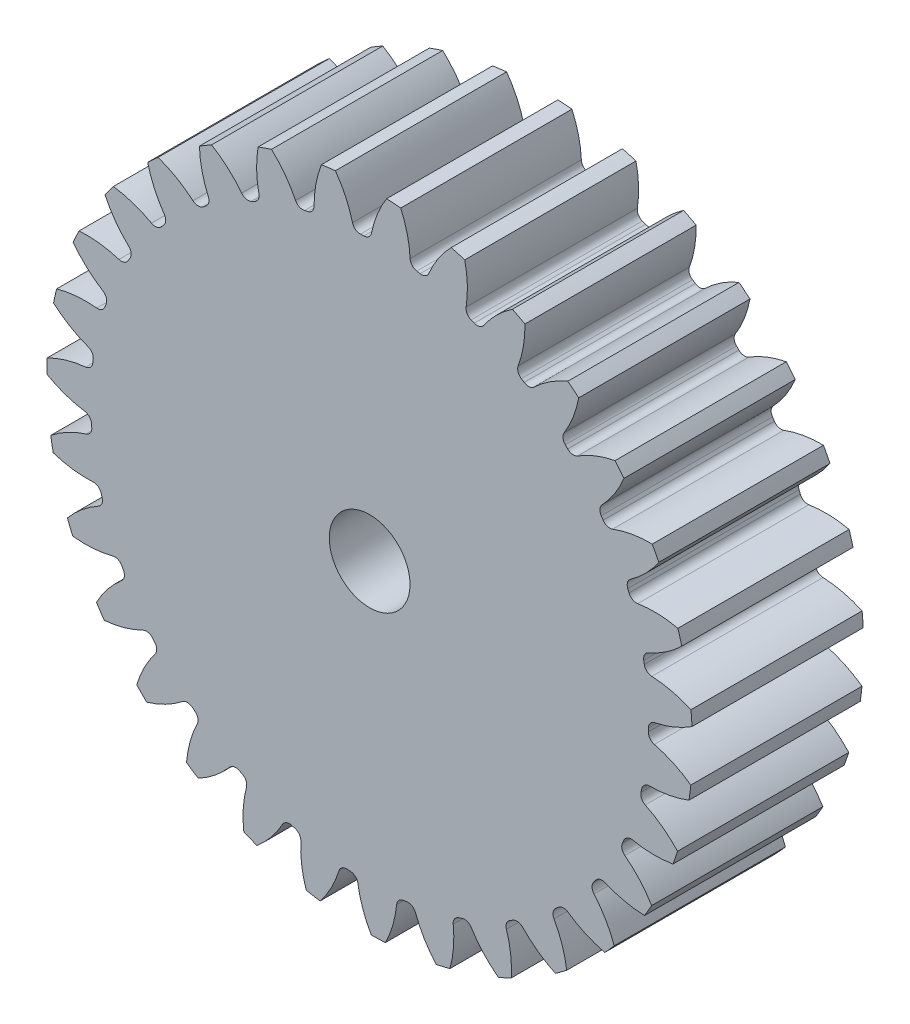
from build123d import *

# Parameters (mm, degrees)
SKETCH3_R         = 167.64
GEARBODY_DEPTH    = 88.9
TOOTHCUT_DEPTH    = 254.198635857
CIRPATTERN1_COUNT = 31
BOREDIA_R         = 20.955
BORE_DEPTH        = 12700


with BuildPart() as part:
    # Sketch3 → gearBody (new body)
    with BuildSketch(Plane.XY):
        Circle(SKETCH3_R)
    extrude(amount=GEARBODY_DEPTH)

    # Sketch2 → toothCut (cut, through all)
    with BuildSketch(Plane.XY):
        with BuildLine():
            ThreePointArc((144.71501811, -4.337272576), (144.73880735, -3.453410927), (144.757198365, -2.569420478))
            ThreePointArc((144.757198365, -2.569420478), (145.710361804, -0.001119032), (148.059771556, 1.407769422))
            ThreePointArc((148.059771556, 1.407769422), (158.233017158, 4.522000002), (167.64, 9.492113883))
            ThreePointArc((167.64, 9.492113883), (167.860743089, -4.005091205), (166.996541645, -17.476409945))
            ThreePointArc((166.996541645, -17.476409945), (157.837298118, -12.063313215), (147.82415287, -8.467443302))
            ThreePointArc((147.82415287, -8.467443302), (145.544609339, -6.948109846), (144.71501811, -4.337272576))
        make_face()
    toothcut = extrude(amount=TOOTHCUT_DEPTH, mode=Mode.SUBTRACT)

    # CirPattern1: toothCut ×31 about axis
    cirpattern1_axis = Axis((0, 0, 0), (0, 0, 1))
    for i in range(1, CIRPATTERN1_COUNT):
        add(toothcut.rotate(cirpattern1_axis, i * 360 / CIRPATTERN1_COUNT), mode=Mode.SUBTRACT)

    # boreDia → bore (cut, symmetric)
    with BuildSketch(Plane.XY):
        Circle(BOREDIA_R)
    extrude(amount=BORE_DEPTH, both=True, mode=Mode.SUBTRACT)


solid = part.part
